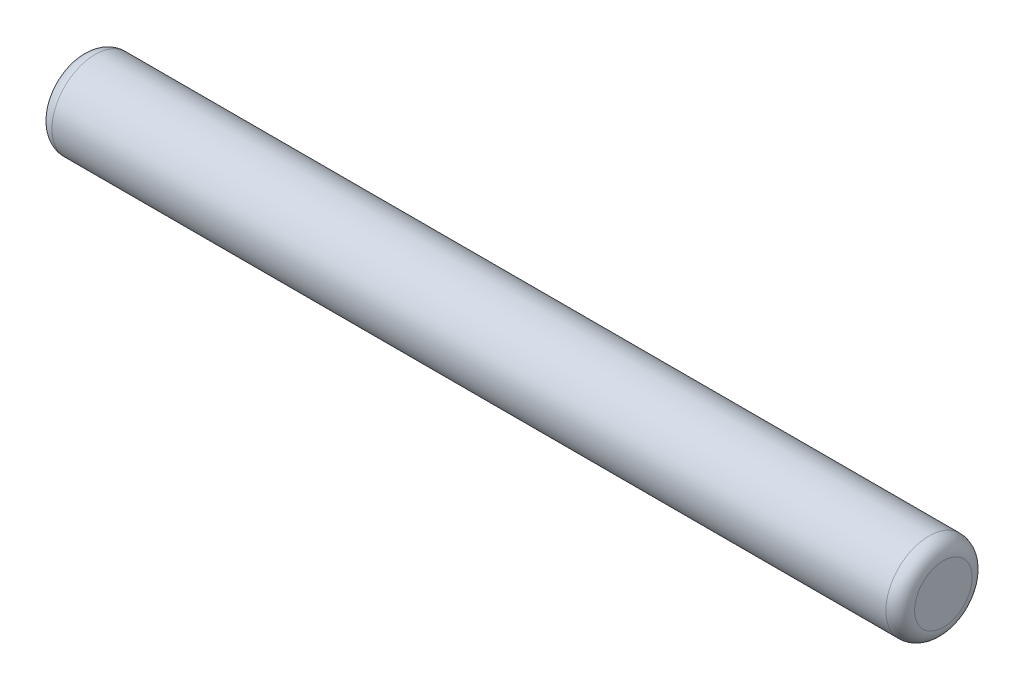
ISO-10303-21;
HEADER;
FILE_DESCRIPTION(('STEP AP214'),'2;1');
FILE_NAME('part.step','',(''),(''),'','','');
FILE_SCHEMA(('AUTOMOTIVE_DESIGN { 1 0 10303 214 1 1 1 1 }'));
ENDSEC;
DATA;
#1=APPLICATION_CONTEXT('core data for automotive mechanical design processes');
#2=APPLICATION_PROTOCOL_DEFINITION('international standard','automotive_design',2000,#1);
#3=PRODUCT_CONTEXT('',#1,'mechanical');
#4=PRODUCT('Part','Part','',(#3));
#5=PRODUCT_RELATED_PRODUCT_CATEGORY('part','',(#4));
#6=PRODUCT_DEFINITION_FORMATION('','',#4);
#7=PRODUCT_DEFINITION_CONTEXT('part definition',#1,'design');
#8=PRODUCT_DEFINITION('design','',#6,#7);
#9=PRODUCT_DEFINITION_SHAPE('','',#8);
#10=(LENGTH_UNIT() NAMED_UNIT(*) SI_UNIT(.MILLI.,.METRE.));
#11=(NAMED_UNIT(*) PLANE_ANGLE_UNIT() SI_UNIT($,.RADIAN.));
#12=(NAMED_UNIT(*) SI_UNIT($,.STERADIAN.) SOLID_ANGLE_UNIT());
#13=UNCERTAINTY_MEASURE_WITH_UNIT(LENGTH_MEASURE(1.E-05),#10,'distance_accuracy_value','');
#14=(GEOMETRIC_REPRESENTATION_CONTEXT(3) GLOBAL_UNCERTAINTY_ASSIGNED_CONTEXT((#13)) GLOBAL_UNIT_ASSIGNED_CONTEXT((#10,
#11,#12)) REPRESENTATION_CONTEXT('',''));
#15=CARTESIAN_POINT('',(0.,0.,0.));
#16=DIRECTION('',(0.,0.,1.));
#17=DIRECTION('',(1.,0.,0.));
#18=AXIS2_PLACEMENT_3D('',#15,#16,#17);
#19=CARTESIAN_POINT('',(0.,0.,0.));
#20=DIRECTION('',(1.,0.,0.));
#21=DIRECTION('',(0.,0.,-1.));
#22=AXIS2_PLACEMENT_3D('',#19,#20,#21);
#23=PLANE('',#22);
#24=CARTESIAN_POINT('',(0.,0.,0.));
#25=DIRECTION('',(1.,0.,0.));
#26=DIRECTION('',(0.,0.,-1.));
#27=AXIS2_PLACEMENT_3D('',#24,#25,#26);
#28=CIRCLE('',#27,1.);
#29=CARTESIAN_POINT('',(0.,0.,-1.));
#30=VERTEX_POINT('',#29);
#31=EDGE_CURVE('E29',#30,#30,#28,.F.);
#32=ORIENTED_EDGE('',*,*,#31,.T.);
#33=EDGE_LOOP('',(#32));
#34=FACE_BOUND('',#33,.T.);
#35=ADVANCED_FACE('F14',(#34),#23,.F.);
#36=CARTESIAN_POINT('',(0.,0.,0.));
#37=DIRECTION('',(-1.,0.,0.));
#38=DIRECTION('',(0.,0.,1.));
#39=AXIS2_PLACEMENT_3D('',#36,#37,#38);
#40=CYLINDRICAL_SURFACE('',#39,1.5);
#41=CARTESIAN_POINT('',(0.5,0.,0.));
#42=DIRECTION('',(1.,0.,0.));
#43=DIRECTION('',(0.,0.,-1.));
#44=AXIS2_PLACEMENT_3D('',#41,#42,#43);
#45=CIRCLE('',#44,1.5);
#46=CARTESIAN_POINT('',(0.5,0.,-1.5));
#47=VERTEX_POINT('',#46);
#48=EDGE_CURVE('E21',#47,#47,#45,.T.);
#49=ORIENTED_EDGE('',*,*,#48,.T.);
#50=EDGE_LOOP('',(#49));
#51=FACE_BOUND('',#50,.T.);
#52=CARTESIAN_POINT('',(29.5,0.,0.));
#53=DIRECTION('',(-1.,0.,0.));
#54=DIRECTION('',(0.,0.,1.));
#55=AXIS2_PLACEMENT_3D('',#52,#53,#54);
#56=CIRCLE('',#55,1.5);
#57=CARTESIAN_POINT('',(29.5,0.,1.5));
#58=VERTEX_POINT('',#57);
#59=EDGE_CURVE('E25',#58,#58,#56,.T.);
#60=ORIENTED_EDGE('',*,*,#59,.T.);
#61=EDGE_LOOP('',(#60));
#62=FACE_BOUND('',#61,.T.);
#63=ADVANCED_FACE('F47',(#51,#62),#40,.T.);
#64=CARTESIAN_POINT('',(30.,1.5,0.));
#65=DIRECTION('',(-1.,0.,0.));
#66=DIRECTION('',(0.,0.,1.));
#67=AXIS2_PLACEMENT_3D('',#64,#65,#66);
#68=PLANE('',#67);
#69=CARTESIAN_POINT('',(30.,0.,0.));
#70=DIRECTION('',(-1.,0.,0.));
#71=DIRECTION('',(0.,0.,1.));
#72=AXIS2_PLACEMENT_3D('',#69,#70,#71);
#73=CIRCLE('',#72,1.);
#74=CARTESIAN_POINT('',(30.,0.,1.));
#75=VERTEX_POINT('',#74);
#76=EDGE_CURVE('E9',#75,#75,#73,.F.);
#77=ORIENTED_EDGE('',*,*,#76,.T.);
#78=EDGE_LOOP('',(#77));
#79=FACE_BOUND('',#78,.T.);
#80=ADVANCED_FACE('F38',(#79),#68,.F.);
#81=CARTESIAN_POINT('',(0.5,0.,0.));
#82=DIRECTION('',(1.,0.,0.));
#83=DIRECTION('',(0.,0.,-1.));
#84=AXIS2_PLACEMENT_3D('',#81,#82,#83);
#85=TOROIDAL_SURFACE('',#84,1.,0.5);
#86=ORIENTED_EDGE('',*,*,#48,.F.);
#87=EDGE_LOOP('',(#86));
#88=FACE_BOUND('',#87,.T.);
#89=ORIENTED_EDGE('',*,*,#31,.F.);
#90=EDGE_LOOP('',(#89));
#91=FACE_BOUND('',#90,.T.);
#92=ADVANCED_FACE('F36',(#88,#91),#85,.T.);
#93=CARTESIAN_POINT('',(29.5,0.,0.));
#94=DIRECTION('',(-1.,0.,0.));
#95=DIRECTION('',(0.,0.,1.));
#96=AXIS2_PLACEMENT_3D('',#93,#94,#95);
#97=TOROIDAL_SURFACE('',#96,1.,0.5);
#98=ORIENTED_EDGE('',*,*,#76,.F.);
#99=EDGE_LOOP('',(#98));
#100=FACE_BOUND('',#99,.T.);
#101=ORIENTED_EDGE('',*,*,#59,.F.);
#102=EDGE_LOOP('',(#101));
#103=FACE_BOUND('',#102,.T.);
#104=ADVANCED_FACE('F16',(#100,#103),#97,.T.);
#105=CLOSED_SHELL('',(#35,#63,#80,#92,#104));
#106=MANIFOLD_SOLID_BREP('B1',#105);
#107=ADVANCED_BREP_SHAPE_REPRESENTATION('',(#18,#106),#14);
#108=SHAPE_DEFINITION_REPRESENTATION(#9,#107);
ENDSEC;
END-ISO-10303-21;
